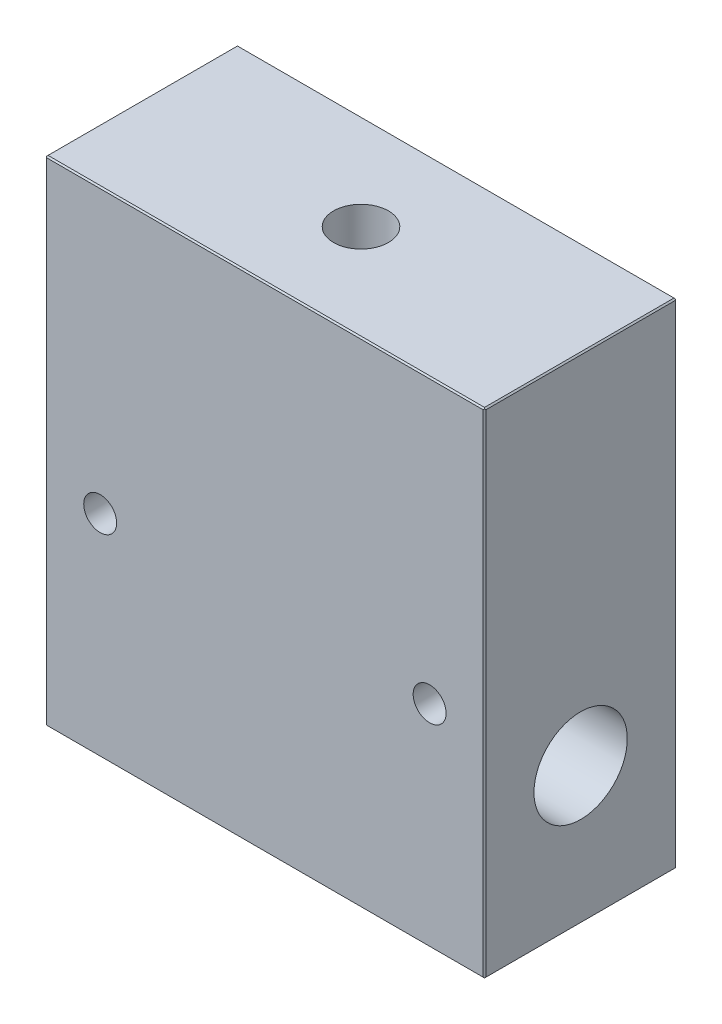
ISO-10303-21;
HEADER;
FILE_DESCRIPTION(('STEP AP214'),'2;1');
FILE_NAME('part.step','',(''),(''),'','','');
FILE_SCHEMA(('AUTOMOTIVE_DESIGN { 1 0 10303 214 1 1 1 1 }'));
ENDSEC;
DATA;
#1=APPLICATION_CONTEXT('core data for automotive mechanical design processes');
#2=APPLICATION_PROTOCOL_DEFINITION('international standard','automotive_design',2000,#1);
#3=PRODUCT_CONTEXT('',#1,'mechanical');
#4=PRODUCT('Part','Part','',(#3));
#5=PRODUCT_RELATED_PRODUCT_CATEGORY('part','',(#4));
#6=PRODUCT_DEFINITION_FORMATION('','',#4);
#7=PRODUCT_DEFINITION_CONTEXT('part definition',#1,'design');
#8=PRODUCT_DEFINITION('design','',#6,#7);
#9=PRODUCT_DEFINITION_SHAPE('','',#8);
#10=(LENGTH_UNIT() NAMED_UNIT(*) SI_UNIT(.MILLI.,.METRE.));
#11=(NAMED_UNIT(*) PLANE_ANGLE_UNIT() SI_UNIT($,.RADIAN.));
#12=(NAMED_UNIT(*) SI_UNIT($,.STERADIAN.) SOLID_ANGLE_UNIT());
#13=UNCERTAINTY_MEASURE_WITH_UNIT(LENGTH_MEASURE(1.E-05),#10,'distance_accuracy_value','');
#14=(GEOMETRIC_REPRESENTATION_CONTEXT(3) GLOBAL_UNCERTAINTY_ASSIGNED_CONTEXT((#13)) GLOBAL_UNIT_ASSIGNED_CONTEXT((#10,
#11,#12)) REPRESENTATION_CONTEXT('',''));
#15=CARTESIAN_POINT('',(0.,0.,0.));
#16=DIRECTION('',(0.,0.,1.));
#17=DIRECTION('',(1.,0.,0.));
#18=AXIS2_PLACEMENT_3D('',#15,#16,#17);
#19=CARTESIAN_POINT('',(92.4,-20.,0.));
#20=DIRECTION('',(-1.,0.,0.));
#21=DIRECTION('',(0.,0.,1.));
#22=AXIS2_PLACEMENT_3D('',#19,#20,#21);
#23=CYLINDRICAL_SURFACE('',#22,9.);
#24=CARTESIAN_POINT('',(80.,-20.,0.));
#25=DIRECTION('',(-1.,0.,0.));
#26=DIRECTION('',(0.,0.,1.));
#27=AXIS2_PLACEMENT_3D('',#24,#25,#26);
#28=CIRCLE('',#27,9.);
#29=CARTESIAN_POINT('',(80.,-20.,9.));
#30=VERTEX_POINT('',#29);
#31=EDGE_CURVE('P0_E10',#30,#30,#28,.T.);
#32=ORIENTED_EDGE('',*,*,#31,.T.);
#33=EDGE_LOOP('',(#32));
#34=FACE_BOUND('',#33,.T.);
#35=CARTESIAN_POINT('',(0.,-20.,0.));
#36=DIRECTION('',(-1.,0.,0.));
#37=DIRECTION('',(0.,0.,1.));
#38=AXIS2_PLACEMENT_3D('',#35,#36,#37);
#39=CIRCLE('',#38,9.);
#40=CARTESIAN_POINT('',(0.,-20.,9.));
#41=VERTEX_POINT('',#40);
#42=EDGE_CURVE('P0_E15',#41,#41,#39,.F.);
#43=ORIENTED_EDGE('',*,*,#42,.T.);
#44=EDGE_LOOP('',(#43));
#45=FACE_BOUND('',#44,.T.);
#46=ADVANCED_FACE('P0_F14',(#34,#45),#23,.T.);
#47=OPEN_SHELL('',(#46));
#48=SHELL_BASED_SURFACE_MODEL('P0_B1',(#47));
#49=CARTESIAN_POINT('',(57.86268102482,15.,0.));
#50=DIRECTION('',(-1.,0.,0.));
#51=DIRECTION('',(0.,0.,1.));
#52=AXIS2_PLACEMENT_3D('',#49,#50,#51);
#53=CYLINDRICAL_SURFACE('',#52,9.);
#54=CARTESIAN_POINT('',(20.,15.,0.));
#55=DIRECTION('',(-1.,0.,0.));
#56=DIRECTION('',(0.,0.,1.));
#57=AXIS2_PLACEMENT_3D('',#54,#55,#56);
#58=CIRCLE('',#57,9.);
#59=CARTESIAN_POINT('',(20.,15.,9.));
#60=VERTEX_POINT('',#59);
#61=EDGE_CURVE('P1_E11',#60,#60,#58,.T.);
#62=ORIENTED_EDGE('',*,*,#61,.T.);
#63=EDGE_LOOP('',(#62));
#64=FACE_BOUND('',#63,.T.);
#65=CARTESIAN_POINT('',(0.,15.,0.));
#66=DIRECTION('',(-1.,0.,0.));
#67=DIRECTION('',(0.,0.,1.));
#68=AXIS2_PLACEMENT_3D('',#65,#66,#67);
#69=CIRCLE('',#68,9.);
#70=CARTESIAN_POINT('',(0.,15.,9.));
#71=VERTEX_POINT('',#70);
#72=EDGE_CURVE('P1_E23',#71,#71,#69,.F.);
#73=ORIENTED_EDGE('',*,*,#72,.T.);
#74=EDGE_LOOP('',(#73));
#75=FACE_BOUND('',#74,.T.);
#76=ADVANCED_FACE('P1_F16',(#64,#75),#53,.T.);
#77=CARTESIAN_POINT('',(20.,15.,0.));
#78=DIRECTION('',(-1.,0.,0.));
#79=DIRECTION('',(0.,0.,1.));
#80=AXIS2_PLACEMENT_3D('',#77,#78,#79);
#81=PLANE('',#80);
#82=CARTESIAN_POINT('',(20.,23.5,0.));
#83=CARTESIAN_POINT('',(20.,23.499902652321,0.780112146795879));
#84=CARTESIAN_POINT('',(20.,23.3580956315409,1.54668594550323));
#85=CARTESIAN_POINT('',(20.,23.2077587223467,2.35937021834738));
#86=CARTESIAN_POINT('',(20.,22.9032005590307,3.12880503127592));
#87=CARTESIAN_POINT('',(20.,22.5862467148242,3.92955625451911));
#88=CARTESIAN_POINT('',(20.,22.1144618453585,4.65128290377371));
#89=CARTESIAN_POINT('',(20.,21.6331449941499,5.3875913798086));
#90=CARTESIAN_POINT('',(20.,21.0104076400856,6.01040764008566));
#91=CARTESIAN_POINT('',(20.,20.3884276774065,6.63246641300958));
#92=CARTESIAN_POINT('',(20.,19.6512829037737,7.11446184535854));
#93=CARTESIAN_POINT('',(20.,18.9304933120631,7.58576314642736));
#94=CARTESIAN_POINT('',(20.,18.1288050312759,7.90320055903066));
#95=CARTESIAN_POINT('',(20.,17.3603791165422,8.20746736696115));
#96=CARTESIAN_POINT('',(20.,16.5466859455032,8.35809563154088));
#97=CARTESIAN_POINT('',(20.,15.7803822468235,8.49995130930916));
#98=CARTESIAN_POINT('',(20.,15.,8.5));
#99=CARTESIAN_POINT('',(20.,14.2206769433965,8.50004862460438));
#100=CARTESIAN_POINT('',(20.,13.4533140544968,8.35809563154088));
#101=CARTESIAN_POINT('',(20.,12.6406297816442,8.20775872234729));
#102=CARTESIAN_POINT('',(20.,11.8711949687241,7.90320055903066));
#103=CARTESIAN_POINT('',(20.,11.0704437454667,7.58624671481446));
#104=CARTESIAN_POINT('',(20.,10.3487170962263,7.11446184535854));
#105=CARTESIAN_POINT('',(20.,9.61240862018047,6.63314499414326));
#106=CARTESIAN_POINT('',(20.,8.98959235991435,6.01040764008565));
#107=CARTESIAN_POINT('',(20.,8.36753358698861,5.3884276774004));
#108=CARTESIAN_POINT('',(20.,7.88553815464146,4.65128290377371));
#109=CARTESIAN_POINT('',(20.,7.41423685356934,3.93049331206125));
#110=CARTESIAN_POINT('',(20.,7.09679944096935,3.12880503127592));
#111=CARTESIAN_POINT('',(20.,6.79253263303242,2.36037911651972));
#112=CARTESIAN_POINT('',(20.,6.64190436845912,1.54668594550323));
#113=CARTESIAN_POINT('',(20.,6.50009741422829,0.780645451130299));
#114=CARTESIAN_POINT('',(20.,6.5,0.));
#115=B_SPLINE_CURVE_WITH_KNOTS('',2,(#82,#83,#84,#85,#86,#87,#88,#89,#90,#91,#92,#93,#94,#95,
#96,#97,#98,#99,#100,#101,#102,#103,#104,#105,#106,#107,#108,#109,#110,#111,#112,#113,#114),
.UNSPECIFIED.,.F.,.F.,(3,2,2,2,2,2,2,2,2,2,2,2,2,2,2,2,3),(0.,0.0625,0.125,0.1875,0.25,0.3125,
0.375,0.4375,0.5,0.5625,0.625,0.6875,0.75,0.8125,0.875,0.9375,1.),.UNSPECIFIED.);
#116=CARTESIAN_POINT('',(20.,23.5,0.));
#117=VERTEX_POINT('',#116);
#118=CARTESIAN_POINT('',(20.,6.5,0.));
#119=VERTEX_POINT('',#118);
#120=EDGE_CURVE('P1_E27',#117,#119,#115,.T.);
#121=ORIENTED_EDGE('',*,*,#120,.F.);
#122=CARTESIAN_POINT('',(20.,6.5,0.));
#123=CARTESIAN_POINT('',(20.,6.50009734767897,-0.780112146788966));
#124=CARTESIAN_POINT('',(20.,6.64190436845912,-1.54668594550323));
#125=CARTESIAN_POINT('',(20.,6.79224127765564,-2.35937021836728));
#126=CARTESIAN_POINT('',(20.,7.09679944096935,-3.12880503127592));
#127=CARTESIAN_POINT('',(20.,7.41375328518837,-3.92955625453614));
#128=CARTESIAN_POINT('',(20.,7.88553815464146,-4.65128290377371));
#129=CARTESIAN_POINT('',(20.,8.36685500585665,-5.38759137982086));
#130=CARTESIAN_POINT('',(20.,8.98959235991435,-6.01040764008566));
#131=CARTESIAN_POINT('',(20.,9.6115723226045,-6.63246641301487));
#132=CARTESIAN_POINT('',(20.,10.3487170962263,-7.11446184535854));
#133=CARTESIAN_POINT('',(20.,11.0695066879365,-7.5857631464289));
#134=CARTESIAN_POINT('',(20.,11.8711949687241,-7.90320055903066));
#135=CARTESIAN_POINT('',(20.,12.6396208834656,-8.2074673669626));
#136=CARTESIAN_POINT('',(20.,13.4533140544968,-8.35809563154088));
#137=CARTESIAN_POINT('',(20.,14.2196177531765,-8.49995130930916));
#138=CARTESIAN_POINT('',(20.,15.,-8.5));
#139=CARTESIAN_POINT('',(20.,15.7793230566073,-8.50004862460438));
#140=CARTESIAN_POINT('',(20.,16.5466859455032,-8.35809563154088));
#141=CARTESIAN_POINT('',(20.,17.3593702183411,-8.20775872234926));
#142=CARTESIAN_POINT('',(20.,18.1288050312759,-7.90320055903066));
#143=CARTESIAN_POINT('',(20.,18.9295562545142,-7.58624671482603));
#144=CARTESIAN_POINT('',(20.,19.6512829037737,-7.11446184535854));
#145=CARTESIAN_POINT('',(20.,20.3875913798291,-6.63314499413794));
#146=CARTESIAN_POINT('',(20.,21.0104076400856,-6.01040764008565));
#147=CARTESIAN_POINT('',(20.,21.6324664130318,-5.3884276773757));
#148=CARTESIAN_POINT('',(20.,22.1144618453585,-4.65128290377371));
#149=CARTESIAN_POINT('',(20.,22.5857631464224,-3.93049331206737));
#150=CARTESIAN_POINT('',(20.,22.9032005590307,-3.12880503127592));
#151=CARTESIAN_POINT('',(20.,23.2074673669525,-2.36037911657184));
#152=CARTESIAN_POINT('',(20.,23.3580956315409,-1.54668594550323));
#153=CARTESIAN_POINT('',(20.,23.4999025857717,-0.780645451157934));
#154=CARTESIAN_POINT('',(20.,23.5,0.));
#155=B_SPLINE_CURVE_WITH_KNOTS('',2,(#122,#123,#124,#125,#126,#127,#128,#129,#130,#131,#132,
#133,#134,#135,#136,#137,#138,#139,#140,#141,#142,#143,#144,#145,#146,#147,#148,#149,#150,#151,
#152,#153,#154),.UNSPECIFIED.,.F.,.F.,(3,2,2,2,2,2,2,2,2,2,2,2,2,2,2,2,3),(0.,0.0625,0.125,
0.1875,0.25,0.3125,0.375,0.4375,0.5,0.5625,0.625,0.6875,0.75,0.8125,0.875,0.9375,1.),.UNSPECIFIED.);
#156=EDGE_CURVE('P1_E32',#119,#117,#155,.T.);
#157=ORIENTED_EDGE('',*,*,#156,.F.);
#158=EDGE_LOOP('',(#121,#157));
#159=FACE_BOUND('',#158,.T.);
#160=ORIENTED_EDGE('',*,*,#61,.F.);
#161=EDGE_LOOP('',(#160));
#162=FACE_BOUND('',#161,.T.);
#163=ADVANCED_FACE('P1_F17',(#159,#162),#81,.F.);
#164=OPEN_SHELL('',(#76,#163));
#165=SHELL_BASED_SURFACE_MODEL('P1_B1',(#164));
#166=CARTESIAN_POINT('',(50.0000000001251,15.,0.));
#167=DIRECTION('',(-1.,0.,0.));
#168=DIRECTION('',(0.,0.,1.));
#169=AXIS2_PLACEMENT_3D('',#166,#167,#168);
#170=CONICAL_SURFACE('',#169,8.4999999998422,1.02974425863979);
#171=CARTESIAN_POINT('',(50.,15.,0.));
#172=DIRECTION('',(-1.,0.,0.));
#173=DIRECTION('',(0.,0.,1.));
#174=AXIS2_PLACEMENT_3D('',#171,#172,#173);
#175=CIRCLE('',#174,8.5);
#176=CARTESIAN_POINT('',(50.,15.,8.5));
#177=VERTEX_POINT('',#176);
#178=EDGE_CURVE('P2_E277',#177,#177,#175,.T.);
#179=ORIENTED_EDGE('',*,*,#178,.T.);
#180=EDGE_LOOP('',(#179));
#181=FACE_BOUND('',#180,.T.);
#182=CARTESIAN_POINT('',(55.107315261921,15.0000000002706,0.));
#183=VERTEX_POINT('',#182);
#184=VERTEX_LOOP('',#183);
#185=FACE_BOUND('',#184,.T.);
#186=ADVANCED_FACE('P2_F16',(#181,#185),#170,.F.);
#187=CARTESIAN_POINT('',(0.,-35.,0.));
#188=DIRECTION('',(0.,-1.,0.));
#189=DIRECTION('',(0.,0.,-1.));
#190=AXIS2_PLACEMENT_3D('',#187,#188,#189);
#191=PLANE('',#190);
#192=CARTESIAN_POINT('',(50.,-35.,0.));
#193=DIRECTION('',(0.,-1.,0.));
#194=DIRECTION('',(0.,0.,-1.));
#195=AXIS2_PLACEMENT_3D('',#192,#193,#194);
#196=CIRCLE('',#195,9.);
#197=CARTESIAN_POINT('',(50.,-35.,-9.));
#198=VERTEX_POINT('',#197);
#199=EDGE_CURVE('P2_E265',#198,#198,#196,.T.);
#200=ORIENTED_EDGE('',*,*,#199,.T.);
#201=EDGE_LOOP('',(#200));
#202=FACE_BOUND('',#201,.T.);
#203=ADVANCED_FACE('P2_F138',(#202),#191,.T.);
#204=CARTESIAN_POINT('',(40.,45.,0.));
#205=DIRECTION('',(0.,-1.,0.));
#206=DIRECTION('',(0.,0.,-1.));
#207=AXIS2_PLACEMENT_3D('',#204,#205,#206);
#208=CYLINDRICAL_SURFACE('',#207,5.);
#209=CARTESIAN_POINT('',(45.,23.5,0.));
#210=CARTESIAN_POINT('',(44.9999988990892,23.4999989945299,0.128357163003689));
#211=CARTESIAN_POINT('',(44.9950492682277,23.4970848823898,0.256756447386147));
#212=CARTESIAN_POINT('',(44.975311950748,23.485497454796,0.512592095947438));
#213=CARTESIAN_POINT('',(44.9605179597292,23.4768204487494,0.640027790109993));
#214=CARTESIAN_POINT('',(44.9212497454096,23.4539011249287,0.893160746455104));
#215=CARTESIAN_POINT('',(44.8967558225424,23.439647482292,1.01885392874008));
#216=CARTESIAN_POINT('',(44.8383943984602,23.4059201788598,1.26737663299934));
#217=CARTESIAN_POINT('',(44.8045228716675,23.3864442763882,1.39020490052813));
#218=CARTESIAN_POINT('',(44.7280157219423,23.3428501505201,1.63150131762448));
#219=CARTESIAN_POINT('',(44.6854283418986,23.3187575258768,1.74998940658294));
#220=CARTESIAN_POINT('',(44.5918227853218,23.2663981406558,1.98265195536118));
#221=CARTESIAN_POINT('',(44.5408013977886,23.2381297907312,2.09682475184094));
#222=CARTESIAN_POINT('',(44.3758588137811,23.1479819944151,2.43181103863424));
#223=CARTESIAN_POINT('',(44.24995724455,23.0807000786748,2.64540972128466));
#224=CARTESIAN_POINT('',(43.9594785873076,22.9316312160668,3.06471449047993));
#225=CARTESIAN_POINT('',(43.7927133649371,22.8491358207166,3.26863586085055));
#226=CARTESIAN_POINT('',(43.4300750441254,22.6804704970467,3.64738378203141));
#227=CARTESIAN_POINT('',(43.2341655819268,22.5942960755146,3.82217339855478));
#228=CARTESIAN_POINT('',(42.7918352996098,22.4161059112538,4.15831930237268));
#229=CARTESIAN_POINT('',(42.542187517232,22.3245831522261,4.31572343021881));
#230=CARTESIAN_POINT('',(42.0146123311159,22.1586631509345,4.58571331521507));
#231=CARTESIAN_POINT('',(41.7367306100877,22.084238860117,4.69837006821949));
#232=CARTESIAN_POINT('',(41.2267586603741,21.9791149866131,4.85268557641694));
#233=CARTESIAN_POINT('',(40.9990955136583,21.9422668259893,4.90477317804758));
#234=CARTESIAN_POINT('',(40.5363562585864,21.8909400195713,4.97664312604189));
#235=CARTESIAN_POINT('',(40.3012891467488,21.8764352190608,4.9964632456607));
#236=CARTESIAN_POINT('',(39.8300745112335,21.8719194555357,5.00267390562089));
#237=CARTESIAN_POINT('',(39.5939258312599,21.8819500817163,4.98900768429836));
#238=CARTESIAN_POINT('',(39.1279302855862,21.925064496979,4.92897337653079));
#239=CARTESIAN_POINT('',(38.8980881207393,21.958165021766,4.88258154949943));
#240=CARTESIAN_POINT('',(38.4524390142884,22.0425387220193,4.76004758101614));
#241=CARTESIAN_POINT('',(38.2365252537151,22.093647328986,4.68417423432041));
#242=CARTESIAN_POINT('',(37.8198741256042,22.2085198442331,4.50538583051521));
#243=CARTESIAN_POINT('',(37.6191424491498,22.2722884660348,4.40246069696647));
#244=CARTESIAN_POINT('',(37.2025657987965,22.418312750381,4.15246403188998));
#245=CARTESIAN_POINT('',(36.9898944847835,22.5018717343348,4.0008723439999));
#246=CARTESIAN_POINT('',(36.59078424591,22.6707247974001,3.66674230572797));
#247=CARTESIAN_POINT('',(36.4043699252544,22.7560204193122,3.48417527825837));
#248=CARTESIAN_POINT('',(36.1359620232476,22.8850247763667,3.17662235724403));
#249=CARTESIAN_POINT('',(36.0438273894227,22.9306793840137,3.0611484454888));
#250=CARTESIAN_POINT('',(35.8696714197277,23.0189758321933,2.82175037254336));
#251=CARTESIAN_POINT('',(35.7876463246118,23.0616187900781,2.69782937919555));
#252=CARTESIAN_POINT('',(35.6344553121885,23.142712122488,2.44217642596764));
#253=CARTESIAN_POINT('',(35.5632874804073,23.1811632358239,2.31044584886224));
#254=CARTESIAN_POINT('',(35.4326065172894,23.2527627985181,2.03996506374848));
#255=CARTESIAN_POINT('',(35.3730899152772,23.2859128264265,1.90121696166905));
#256=CARTESIAN_POINT('',(35.2766002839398,23.3402178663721,1.64455871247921));
#257=CARTESIAN_POINT('',(35.2374925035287,23.3624556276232,1.5276755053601));
#258=CARTESIAN_POINT('',(35.1678618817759,23.4023057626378,1.29061751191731));
#259=CARTESIAN_POINT('',(35.1373374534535,23.4199189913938,1.17044333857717));
#260=CARTESIAN_POINT('',(35.0852840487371,23.4500878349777,0.927858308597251));
#261=CARTESIAN_POINT('',(35.0637328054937,23.4626559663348,0.805453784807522));
#262=CARTESIAN_POINT('',(35.0297918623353,23.4824983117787,0.559004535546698));
#263=CARTESIAN_POINT('',(35.0173968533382,23.4897755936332,0.434960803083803));
#264=CARTESIAN_POINT('',(35.0064382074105,23.4962141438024,0.258891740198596));
#265=CARTESIAN_POINT('',(35.0040248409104,23.4976329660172,0.207158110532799));
#266=CARTESIAN_POINT('',(35.0008054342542,23.4995261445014,0.103618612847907));
#267=CARTESIAN_POINT('',(34.9999995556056,23.5000004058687,0.051812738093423));
#268=CARTESIAN_POINT('',(35.0000011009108,23.4999989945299,-0.128357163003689));
#269=CARTESIAN_POINT('',(35.0049507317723,23.4970848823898,-0.256756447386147));
#270=CARTESIAN_POINT('',(35.024688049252,23.485497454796,-0.512592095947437));
#271=CARTESIAN_POINT('',(35.0394820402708,23.4768204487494,-0.640027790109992));
#272=CARTESIAN_POINT('',(35.0787502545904,23.4539011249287,-0.893160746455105));
#273=CARTESIAN_POINT('',(35.1032441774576,23.439647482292,-1.01885392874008));
#274=CARTESIAN_POINT('',(35.1616056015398,23.4059201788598,-1.26737663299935));
#275=CARTESIAN_POINT('',(35.1954771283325,23.3864442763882,-1.39020490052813));
#276=CARTESIAN_POINT('',(35.2719842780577,23.3428501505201,-1.63150131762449));
#277=CARTESIAN_POINT('',(35.3145716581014,23.3187575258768,-1.74998940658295));
#278=CARTESIAN_POINT('',(35.4081772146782,23.2663981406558,-1.98265195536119));
#279=CARTESIAN_POINT('',(35.4591986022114,23.2381297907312,-2.09682475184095));
#280=CARTESIAN_POINT('',(35.6241411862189,23.1479819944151,-2.43181103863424));
#281=CARTESIAN_POINT('',(35.75004275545,23.0807000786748,-2.64540972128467));
#282=CARTESIAN_POINT('',(36.0405214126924,22.9316312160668,-3.06471449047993));
#283=CARTESIAN_POINT('',(36.2072866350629,22.8491358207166,-3.26863586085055));
#284=CARTESIAN_POINT('',(36.5699249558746,22.6804704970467,-3.64738378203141));
#285=CARTESIAN_POINT('',(36.7658344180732,22.5942960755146,-3.82217339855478));
#286=CARTESIAN_POINT('',(37.2081647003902,22.4161059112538,-4.15831930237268));
#287=CARTESIAN_POINT('',(37.457812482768,22.3245831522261,-4.31572343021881));
#288=CARTESIAN_POINT('',(37.9853876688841,22.1586631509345,-4.58571331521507));
#289=CARTESIAN_POINT('',(38.2632693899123,22.084238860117,-4.69837006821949));
#290=CARTESIAN_POINT('',(38.773241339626,21.9791149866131,-4.85268557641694));
#291=CARTESIAN_POINT('',(39.0009044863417,21.9422668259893,-4.90477317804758));
#292=CARTESIAN_POINT('',(39.4636437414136,21.8909400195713,-4.97664312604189));
#293=CARTESIAN_POINT('',(39.6987108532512,21.8764352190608,-4.9964632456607));
#294=CARTESIAN_POINT('',(40.1699254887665,21.8719194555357,-5.00267390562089));
#295=CARTESIAN_POINT('',(40.4060741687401,21.8819500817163,-4.98900768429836));
#296=CARTESIAN_POINT('',(40.8720697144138,21.925064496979,-4.92897337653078));
#297=CARTESIAN_POINT('',(41.1019118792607,21.958165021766,-4.88258154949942));
#298=CARTESIAN_POINT('',(41.5475609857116,22.0425387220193,-4.76004758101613));
#299=CARTESIAN_POINT('',(41.763474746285,22.093647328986,-4.6841742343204));
#300=CARTESIAN_POINT('',(42.1801258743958,22.2085198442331,-4.50538583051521));
#301=CARTESIAN_POINT('',(42.3808575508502,22.2722884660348,-4.40246069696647));
#302=CARTESIAN_POINT('',(42.7974342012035,22.418312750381,-4.15246403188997));
#303=CARTESIAN_POINT('',(43.0101055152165,22.5018717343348,-4.00087234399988));
#304=CARTESIAN_POINT('',(43.40921575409,22.6707247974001,-3.66674230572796));
#305=CARTESIAN_POINT('',(43.5956300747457,22.7560204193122,-3.48417527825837));
#306=CARTESIAN_POINT('',(43.8640379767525,22.8850247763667,-3.17662235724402));
#307=CARTESIAN_POINT('',(43.9561726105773,22.9306793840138,-3.06114844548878));
#308=CARTESIAN_POINT('',(44.1303285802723,23.0189758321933,-2.82175037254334));
#309=CARTESIAN_POINT('',(44.2123536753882,23.0616187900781,-2.69782937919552));
#310=CARTESIAN_POINT('',(44.3655446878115,23.142712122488,-2.44217642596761));
#311=CARTESIAN_POINT('',(44.4367125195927,23.1811632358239,-2.31044584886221));
#312=CARTESIAN_POINT('',(44.5673934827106,23.2527627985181,-2.03996506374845));
#313=CARTESIAN_POINT('',(44.6269100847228,23.2859128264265,-1.90121696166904));
#314=CARTESIAN_POINT('',(44.7233997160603,23.3402178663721,-1.64455871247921));
#315=CARTESIAN_POINT('',(44.7625074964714,23.3624556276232,-1.52767550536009));
#316=CARTESIAN_POINT('',(44.8321381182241,23.4023057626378,-1.29061751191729));
#317=CARTESIAN_POINT('',(44.8626625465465,23.4199189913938,-1.17044333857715));
#318=CARTESIAN_POINT('',(44.9147159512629,23.4500878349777,-0.927858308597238));
#319=CARTESIAN_POINT('',(44.9362671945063,23.4626559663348,-0.80545378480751));
#320=CARTESIAN_POINT('',(44.9702081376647,23.4824983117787,-0.559004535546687));
#321=CARTESIAN_POINT('',(44.9826031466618,23.4897755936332,-0.434960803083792));
#322=CARTESIAN_POINT('',(44.9935617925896,23.4962141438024,-0.258891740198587));
#323=CARTESIAN_POINT('',(44.9959751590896,23.4976329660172,-0.207158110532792));
#324=CARTESIAN_POINT('',(44.9991945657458,23.4995261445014,-0.103618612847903));
#325=CARTESIAN_POINT('',(45.0000004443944,23.5000004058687,-0.0518127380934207));
#326=CARTESIAN_POINT('',(45.,23.5,0.));
#327=B_SPLINE_CURVE_WITH_KNOTS('',3,(#209,#210,#211,#212,#213,#214,#215,#216,#217,#218,#219,
#220,#221,#222,#223,#224,#225,#226,#227,#228,#229,#230,#231,#232,#233,#234,#235,#236,#237,#238,
#239,#240,#241,#242,#243,#244,#245,#246,#247,#248,#249,#250,#251,#252,#253,#254,#255,#256,#257,
#258,#259,#260,#261,#262,#263,#264,#265,#266,#267,#268,#269,#270,#271,#272,#273,#274,#275,#276,
#277,#278,#279,#280,#281,#282,#283,#284,#285,#286,#287,#288,#289,#290,#291,#292,#293,#294,#295,
#296,#297,#298,#299,#300,#301,#302,#303,#304,#305,#306,#307,#308,#309,#310,#311,#312,#313,#314,
#315,#316,#317,#318,#319,#320,#321,#322,#323,#324,#325,#326),.UNSPECIFIED.,.T.,.F.,(4,2,2,2,2,2,
2,2,2,2,2,2,2,2,2,2,2,2,2,2,2,2,2,2,2,2,2,2,2,2,2,2,2,2,2,2,2,2,2,2,2,2,2,2,2,2,2,2,2,2,2,2,2,2,
2,2,2,2,4),(0.,0.38501700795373,0.770280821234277,1.15633111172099,1.54254738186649,
1.92668108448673,2.31096137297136,3.07851763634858,3.90347279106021,4.72946602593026,
5.65191433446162,6.57289319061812,7.27916762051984,7.98461466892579,8.69125832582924,
9.39841514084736,10.0992703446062,10.8003869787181,11.6199219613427,12.4402198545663,
12.9035785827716,13.3667644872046,13.8298686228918,14.2928345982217,14.6681669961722,
15.0434299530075,15.417756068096,15.7918649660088,15.9472655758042,16.1026817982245,
16.4876988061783,16.8729626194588,17.2590129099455,17.645229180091,18.0293628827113,
18.4136431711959,19.1811994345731,20.0061545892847,20.8321478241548,21.7545961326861,
22.6755749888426,23.3818494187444,24.0872964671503,24.7939401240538,25.5010969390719,
26.2019521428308,26.9030687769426,27.7226037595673,28.5429016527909,29.0062603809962,
29.4694462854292,29.9325504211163,30.3955163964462,30.7708487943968,31.146111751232,
31.5204378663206,31.8945467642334,32.0499473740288,32.2053635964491),.UNSPECIFIED.);
#328=CARTESIAN_POINT('',(45.,23.5,0.));
#329=VERTEX_POINT('',#328);
#330=EDGE_CURVE('P2_E19',#329,#329,#327,.T.);
#331=ORIENTED_EDGE('',*,*,#330,.T.);
#332=EDGE_LOOP('',(#331));
#333=FACE_BOUND('',#332,.T.);
#334=CARTESIAN_POINT('',(40.,45.,0.));
#335=DIRECTION('',(0.,-1.,0.));
#336=DIRECTION('',(0.,0.,-1.));
#337=AXIS2_PLACEMENT_3D('',#334,#335,#336);
#338=CIRCLE('',#337,5.);
#339=CARTESIAN_POINT('',(40.,45.,-5.));
#340=VERTEX_POINT('',#339);
#341=EDGE_CURVE('P2_E253',#340,#340,#338,.T.);
#342=ORIENTED_EDGE('',*,*,#341,.F.);
#343=EDGE_LOOP('',(#342));
#344=FACE_BOUND('',#343,.T.);
#345=ADVANCED_FACE('P2_F145',(#333,#344),#208,.F.);
#346=CARTESIAN_POINT('',(0.125,44.875,0.));
#347=DIRECTION('',(-0.707106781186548,0.707106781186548,0.));
#348=DIRECTION('',(-0.707106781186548,-0.707106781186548,0.));
#349=AXIS2_PLACEMENT_3D('',#346,#347,#348);
#350=PLANE('',#349);
#351=DIRECTION('',(0.577350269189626,0.577350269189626,-0.577350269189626));
#352=VECTOR('',#351,1.);
#353=CARTESIAN_POINT('',(0.125,44.875,17.375));
#354=LINE('',#353,#352);
#355=CARTESIAN_POINT('',(0.124999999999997,44.875,17.375));
#356=VERTEX_POINT('',#355);
#357=CARTESIAN_POINT('',(0.249999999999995,45.,17.25));
#358=VERTEX_POINT('',#357);
#359=EDGE_CURVE('P2_E133',#356,#358,#354,.T.);
#360=ORIENTED_EDGE('',*,*,#359,.T.);
#361=DIRECTION('',(0.,0.,1.));
#362=VECTOR('',#361,1.);
#363=CARTESIAN_POINT('',(0.25,45.,-17.5));
#364=LINE('',#363,#362);
#365=CARTESIAN_POINT('',(0.249999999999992,45.,-17.25));
#366=VERTEX_POINT('',#365);
#367=EDGE_CURVE('P2_E327',#366,#358,#364,.T.);
#368=ORIENTED_EDGE('',*,*,#367,.F.);
#369=DIRECTION('',(0.577350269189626,0.577350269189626,0.577350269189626));
#370=VECTOR('',#369,1.);
#371=CARTESIAN_POINT('',(0.124999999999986,44.875,-17.375));
#372=LINE('',#371,#370);
#373=CARTESIAN_POINT('',(0.124999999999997,44.875,-17.375));
#374=VERTEX_POINT('',#373);
#375=EDGE_CURVE('P2_E341',#374,#366,#372,.T.);
#376=ORIENTED_EDGE('',*,*,#375,.F.);
#377=DIRECTION('',(0.577350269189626,0.577350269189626,-0.577350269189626));
#378=VECTOR('',#377,1.);
#379=CARTESIAN_POINT('',(0.,44.75,-17.25));
#380=LINE('',#379,#378);
#381=CARTESIAN_POINT('',(0.,44.75,-17.25));
#382=VERTEX_POINT('',#381);
#383=EDGE_CURVE('P2_E355',#382,#374,#380,.T.);
#384=ORIENTED_EDGE('',*,*,#383,.F.);
#385=DIRECTION('',(0.,0.,-1.));
#386=VECTOR('',#385,1.);
#387=CARTESIAN_POINT('',(0.,44.75,0.));
#388=LINE('',#387,#386);
#389=CARTESIAN_POINT('',(0.,44.75,17.25));
#390=VERTEX_POINT('',#389);
#391=EDGE_CURVE('P2_E315',#382,#390,#388,.F.);
#392=ORIENTED_EDGE('',*,*,#391,.T.);
#393=DIRECTION('',(0.577350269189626,0.577350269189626,0.577350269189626));
#394=VECTOR('',#393,1.);
#395=CARTESIAN_POINT('',(0.,44.75,17.25));
#396=LINE('',#395,#394);
#397=EDGE_CURVE('P2_E282',#390,#356,#396,.T.);
#398=ORIENTED_EDGE('',*,*,#397,.T.);
#399=EDGE_LOOP('',(#360,#368,#376,#384,#392,#398));
#400=FACE_BOUND('',#399,.T.);
#401=ADVANCED_FACE('P2_F238',(#400),#350,.T.);
#402=CARTESIAN_POINT('',(57.86268102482,15.,0.));
#403=DIRECTION('',(-1.,0.,0.));
#404=DIRECTION('',(0.,0.,1.));
#405=AXIS2_PLACEMENT_3D('',#402,#403,#404);
#406=CYLINDRICAL_SURFACE('',#405,8.5);
#407=CARTESIAN_POINT('',(0.,15.,0.));
#408=DIRECTION('',(-1.,0.,0.));
#409=DIRECTION('',(0.,0.,1.));
#410=AXIS2_PLACEMENT_3D('',#407,#408,#409);
#411=CIRCLE('',#410,8.5);
#412=CARTESIAN_POINT('',(0.,15.,8.5));
#413=VERTEX_POINT('',#412);
#414=EDGE_CURVE('P2_E263',#413,#413,#411,.T.);
#415=ORIENTED_EDGE('',*,*,#414,.T.);
#416=EDGE_LOOP('',(#415));
#417=FACE_BOUND('',#416,.T.);
#418=ORIENTED_EDGE('',*,*,#178,.F.);
#419=EDGE_LOOP('',(#418));
#420=FACE_BOUND('',#419,.T.);
#421=ORIENTED_EDGE('',*,*,#330,.F.);
#422=EDGE_LOOP('',(#421));
#423=FACE_BOUND('',#422,.T.);
#424=ADVANCED_FACE('P2_F233',(#417,#420,#423),#406,.F.);
#425=CARTESIAN_POINT('',(0.125,-44.875,0.));
#426=DIRECTION('',(-0.707106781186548,-0.707106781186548,0.));
#427=DIRECTION('',(0.707106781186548,-0.707106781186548,0.));
#428=AXIS2_PLACEMENT_3D('',#425,#426,#427);
#429=PLANE('',#428);
#430=DIRECTION('',(-0.577350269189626,0.577350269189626,-0.577350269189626));
#431=VECTOR('',#430,1.);
#432=CARTESIAN_POINT('',(0.125,-44.875,17.375));
#433=LINE('',#432,#431);
#434=CARTESIAN_POINT('',(0.124999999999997,-44.875,17.375));
#435=VERTEX_POINT('',#434);
#436=CARTESIAN_POINT('',(0.,-44.75,17.25));
#437=VERTEX_POINT('',#436);
#438=EDGE_CURVE('P2_E268',#435,#437,#433,.T.);
#439=ORIENTED_EDGE('',*,*,#438,.T.);
#440=DIRECTION('',(0.,0.,-1.));
#441=VECTOR('',#440,1.);
#442=CARTESIAN_POINT('',(0.,-44.75,0.));
#443=LINE('',#442,#441);
#444=CARTESIAN_POINT('',(0.,-44.75,-17.25));
#445=VERTEX_POINT('',#444);
#446=EDGE_CURVE('P2_E254',#437,#445,#443,.T.);
#447=ORIENTED_EDGE('',*,*,#446,.T.);
#448=DIRECTION('',(-0.577350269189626,0.577350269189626,0.577350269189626));
#449=VECTOR('',#448,1.);
#450=CARTESIAN_POINT('',(0.125,-44.875,-17.375));
#451=LINE('',#450,#449);
#452=CARTESIAN_POINT('',(0.124999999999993,-44.875,-17.375));
#453=VERTEX_POINT('',#452);
#454=EDGE_CURVE('P2_E349',#453,#445,#451,.T.);
#455=ORIENTED_EDGE('',*,*,#454,.F.);
#456=DIRECTION('',(-0.577350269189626,0.577350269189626,-0.577350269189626));
#457=VECTOR('',#456,1.);
#458=CARTESIAN_POINT('',(0.249999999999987,-45.,-17.25));
#459=LINE('',#458,#457);
#460=CARTESIAN_POINT('',(0.249999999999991,-45.,-17.25));
#461=VERTEX_POINT('',#460);
#462=EDGE_CURVE('P2_E357',#461,#453,#459,.T.);
#463=ORIENTED_EDGE('',*,*,#462,.F.);
#464=DIRECTION('',(0.,0.,-1.));
#465=VECTOR('',#464,1.);
#466=CARTESIAN_POINT('',(0.25,-45.,17.5));
#467=LINE('',#466,#465);
#468=CARTESIAN_POINT('',(0.249999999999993,-45.,17.25));
#469=VERTEX_POINT('',#468);
#470=EDGE_CURVE('P2_E305',#469,#461,#467,.T.);
#471=ORIENTED_EDGE('',*,*,#470,.F.);
#472=DIRECTION('',(-0.577350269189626,0.577350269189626,0.577350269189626));
#473=VECTOR('',#472,1.);
#474=CARTESIAN_POINT('',(0.25,-45.,17.25));
#475=LINE('',#474,#473);
#476=EDGE_CURVE('P2_E273',#469,#435,#475,.T.);
#477=ORIENTED_EDGE('',*,*,#476,.T.);
#478=EDGE_LOOP('',(#439,#447,#455,#463,#471,#477));
#479=FACE_BOUND('',#478,.T.);
#480=ADVANCED_FACE('P2_F230',(#479),#429,.T.);
#481=CARTESIAN_POINT('',(50.,-45.,0.));
#482=DIRECTION('',(0.,-1.,0.));
#483=DIRECTION('',(0.,0.,-1.));
#484=AXIS2_PLACEMENT_3D('',#481,#482,#483);
#485=CYLINDRICAL_SURFACE('',#484,9.);
#486=ORIENTED_EDGE('',*,*,#199,.F.);
#487=EDGE_LOOP('',(#486));
#488=FACE_BOUND('',#487,.T.);
#489=CARTESIAN_POINT('',(50.,-45.,0.));
#490=DIRECTION('',(0.,-1.,0.));
#491=DIRECTION('',(0.,0.,-1.));
#492=AXIS2_PLACEMENT_3D('',#489,#490,#491);
#493=CIRCLE('',#492,9.);
#494=CARTESIAN_POINT('',(50.,-45.,-9.));
#495=VERTEX_POINT('',#494);
#496=EDGE_CURVE('P2_E302',#495,#495,#493,.F.);
#497=ORIENTED_EDGE('',*,*,#496,.F.);
#498=EDGE_LOOP('',(#497));
#499=FACE_BOUND('',#498,.T.);
#500=ADVANCED_FACE('P2_F226',(#488,#499),#485,.F.);
#501=CARTESIAN_POINT('',(79.875,-44.875,0.));
#502=DIRECTION('',(0.707106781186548,-0.707106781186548,0.));
#503=DIRECTION('',(0.707106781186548,0.707106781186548,0.));
#504=AXIS2_PLACEMENT_3D('',#501,#502,#503);
#505=PLANE('',#504);
#506=DIRECTION('',(-0.577350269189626,-0.577350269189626,-0.577350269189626));
#507=VECTOR('',#506,1.);
#508=CARTESIAN_POINT('',(79.875,-44.875,17.375));
#509=LINE('',#508,#507);
#510=CARTESIAN_POINT('',(79.875,-44.875,17.375));
#511=VERTEX_POINT('',#510);
#512=CARTESIAN_POINT('',(79.75,-45.,17.25));
#513=VERTEX_POINT('',#512);
#514=EDGE_CURVE('P2_E271',#511,#513,#509,.T.);
#515=ORIENTED_EDGE('',*,*,#514,.T.);
#516=DIRECTION('',(0.,0.,-1.));
#517=VECTOR('',#516,1.);
#518=CARTESIAN_POINT('',(79.75,-45.,17.5));
#519=LINE('',#518,#517);
#520=CARTESIAN_POINT('',(79.75,-45.,-17.25));
#521=VERTEX_POINT('',#520);
#522=EDGE_CURVE('P2_E312',#521,#513,#519,.F.);
#523=ORIENTED_EDGE('',*,*,#522,.F.);
#524=DIRECTION('',(-0.577350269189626,-0.577350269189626,0.577350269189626));
#525=VECTOR('',#524,1.);
#526=CARTESIAN_POINT('',(79.875,-44.875,-17.375));
#527=LINE('',#526,#525);
#528=CARTESIAN_POINT('',(79.875,-44.875,-17.375));
#529=VERTEX_POINT('',#528);
#530=EDGE_CURVE('P2_E359',#529,#521,#527,.T.);
#531=ORIENTED_EDGE('',*,*,#530,.F.);
#532=DIRECTION('',(-0.577350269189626,-0.577350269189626,-0.577350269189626));
#533=VECTOR('',#532,1.);
#534=CARTESIAN_POINT('',(80.,-44.75,-17.25));
#535=LINE('',#534,#533);
#536=CARTESIAN_POINT('',(80.,-44.75,-17.25));
#537=VERTEX_POINT('',#536);
#538=EDGE_CURVE('P2_E333',#537,#529,#535,.T.);
#539=ORIENTED_EDGE('',*,*,#538,.F.);
#540=DIRECTION('',(0.,0.,-1.));
#541=VECTOR('',#540,1.);
#542=CARTESIAN_POINT('',(80.,-44.75,0.));
#543=LINE('',#542,#541);
#544=CARTESIAN_POINT('',(80.,-44.75,17.25));
#545=VERTEX_POINT('',#544);
#546=EDGE_CURVE('P2_E304',#545,#537,#543,.T.);
#547=ORIENTED_EDGE('',*,*,#546,.F.);
#548=DIRECTION('',(-0.577350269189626,-0.577350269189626,0.577350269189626));
#549=VECTOR('',#548,1.);
#550=CARTESIAN_POINT('',(80.,-44.75,17.25));
#551=LINE('',#550,#549);
#552=EDGE_CURVE('P2_E267',#545,#511,#551,.T.);
#553=ORIENTED_EDGE('',*,*,#552,.T.);
#554=EDGE_LOOP('',(#515,#523,#531,#539,#547,#553));
#555=FACE_BOUND('',#554,.T.);
#556=ADVANCED_FACE('P2_F222',(#555),#505,.T.);
#557=CARTESIAN_POINT('',(79.875,44.875,0.));
#558=DIRECTION('',(0.707106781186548,0.707106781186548,0.));
#559=DIRECTION('',(-0.707106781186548,0.707106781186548,0.));
#560=AXIS2_PLACEMENT_3D('',#557,#558,#559);
#561=PLANE('',#560);
#562=DIRECTION('',(0.577350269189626,-0.577350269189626,-0.577350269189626));
#563=VECTOR('',#562,1.);
#564=CARTESIAN_POINT('',(79.875,44.875,17.375));
#565=LINE('',#564,#563);
#566=CARTESIAN_POINT('',(79.875,44.875,17.375));
#567=VERTEX_POINT('',#566);
#568=CARTESIAN_POINT('',(80.,44.75,17.25));
#569=VERTEX_POINT('',#568);
#570=EDGE_CURVE('P2_E361',#567,#569,#565,.T.);
#571=ORIENTED_EDGE('',*,*,#570,.T.);
#572=DIRECTION('',(0.,0.,-1.));
#573=VECTOR('',#572,1.);
#574=CARTESIAN_POINT('',(80.,44.75,0.));
#575=LINE('',#574,#573);
#576=CARTESIAN_POINT('',(80.,44.75,-17.25));
#577=VERTEX_POINT('',#576);
#578=EDGE_CURVE('P2_E301',#577,#569,#575,.F.);
#579=ORIENTED_EDGE('',*,*,#578,.F.);
#580=DIRECTION('',(0.577350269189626,-0.577350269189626,0.577350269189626));
#581=VECTOR('',#580,1.);
#582=CARTESIAN_POINT('',(79.875,44.875,-17.375));
#583=LINE('',#582,#581);
#584=CARTESIAN_POINT('',(79.875,44.875,-17.375));
#585=VERTEX_POINT('',#584);
#586=EDGE_CURVE('P2_E336',#585,#577,#583,.T.);
#587=ORIENTED_EDGE('',*,*,#586,.F.);
#588=DIRECTION('',(0.577350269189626,-0.577350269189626,-0.577350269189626));
#589=VECTOR('',#588,1.);
#590=CARTESIAN_POINT('',(79.75,45.,-17.25));
#591=LINE('',#590,#589);
#592=CARTESIAN_POINT('',(79.75,45.,-17.25));
#593=VERTEX_POINT('',#592);
#594=EDGE_CURVE('P2_E347',#593,#585,#591,.T.);
#595=ORIENTED_EDGE('',*,*,#594,.F.);
#596=DIRECTION('',(0.,0.,1.));
#597=VECTOR('',#596,1.);
#598=CARTESIAN_POINT('',(79.75,45.,-17.5));
#599=LINE('',#598,#597);
#600=CARTESIAN_POINT('',(79.75,45.,17.25));
#601=VERTEX_POINT('',#600);
#602=EDGE_CURVE('P2_E260',#601,#593,#599,.F.);
#603=ORIENTED_EDGE('',*,*,#602,.F.);
#604=DIRECTION('',(0.577350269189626,-0.577350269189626,0.577350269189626));
#605=VECTOR('',#604,1.);
#606=CARTESIAN_POINT('',(79.75,45.,17.25));
#607=LINE('',#606,#605);
#608=EDGE_CURVE('P2_E363',#601,#567,#607,.T.);
#609=ORIENTED_EDGE('',*,*,#608,.T.);
#610=EDGE_LOOP('',(#571,#579,#587,#595,#603,#609));
#611=FACE_BOUND('',#610,.T.);
#612=ADVANCED_FACE('P2_F218',(#611),#561,.T.);
#613=CARTESIAN_POINT('',(92.4,-20.,0.));
#614=DIRECTION('',(-1.,0.,0.));
#615=DIRECTION('',(0.,0.,1.));
#616=AXIS2_PLACEMENT_3D('',#613,#614,#615);
#617=CYLINDRICAL_SURFACE('',#616,8.5);
#618=CARTESIAN_POINT('',(80.,-20.,0.));
#619=DIRECTION('',(-1.,0.,0.));
#620=DIRECTION('',(0.,0.,1.));
#621=AXIS2_PLACEMENT_3D('',#618,#619,#620);
#622=CIRCLE('',#621,8.5);
#623=CARTESIAN_POINT('',(80.,-20.,8.5));
#624=VERTEX_POINT('',#623);
#625=EDGE_CURVE('P2_E297',#624,#624,#622,.T.);
#626=ORIENTED_EDGE('',*,*,#625,.F.);
#627=EDGE_LOOP('',(#626));
#628=FACE_BOUND('',#627,.T.);
#629=CARTESIAN_POINT('',(0.,-20.,0.));
#630=DIRECTION('',(-1.,0.,0.));
#631=DIRECTION('',(0.,0.,1.));
#632=AXIS2_PLACEMENT_3D('',#629,#630,#631);
#633=CIRCLE('',#632,8.5);
#634=CARTESIAN_POINT('',(0.,-20.,8.5));
#635=VERTEX_POINT('',#634);
#636=EDGE_CURVE('P2_E306',#635,#635,#633,.T.);
#637=ORIENTED_EDGE('',*,*,#636,.T.);
#638=EDGE_LOOP('',(#637));
#639=FACE_BOUND('',#638,.T.);
#640=ADVANCED_FACE('P2_F214',(#628,#639),#617,.F.);
#641=CARTESIAN_POINT('',(40.,-44.875,-17.375));
#642=DIRECTION('',(0.,-0.707106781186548,-0.707106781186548));
#643=DIRECTION('',(0.,0.707106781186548,-0.707106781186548));
#644=AXIS2_PLACEMENT_3D('',#641,#642,#643);
#645=PLANE('',#644);
#646=DIRECTION('',(-0.577350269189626,-0.577350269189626,0.577350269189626));
#647=VECTOR('',#646,1.);
#648=CARTESIAN_POINT('',(0.25,-44.75,-17.5));
#649=LINE('',#648,#647);
#650=CARTESIAN_POINT('',(0.249999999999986,-44.75,-17.5));
#651=VERTEX_POINT('',#650);
#652=EDGE_CURVE('P2_E352',#651,#453,#649,.T.);
#653=ORIENTED_EDGE('',*,*,#652,.F.);
#654=DIRECTION('',(-1.,0.,0.));
#655=VECTOR('',#654,1.);
#656=CARTESIAN_POINT('',(0.,-44.75,-17.5));
#657=LINE('',#656,#655);
#658=CARTESIAN_POINT('',(79.75,-44.75,-17.5));
#659=VERTEX_POINT('',#658);
#660=EDGE_CURVE('P2_E300',#659,#651,#657,.T.);
#661=ORIENTED_EDGE('',*,*,#660,.F.);
#662=DIRECTION('',(-0.577350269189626,0.577350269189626,-0.577350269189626));
#663=VECTOR('',#662,1.);
#664=CARTESIAN_POINT('',(79.875,-44.875,-17.375));
#665=LINE('',#664,#663);
#666=EDGE_CURVE('P2_E330',#529,#659,#665,.T.);
#667=ORIENTED_EDGE('',*,*,#666,.F.);
#668=ORIENTED_EDGE('',*,*,#530,.T.);
#669=DIRECTION('',(1.,0.,0.));
#670=VECTOR('',#669,1.);
#671=CARTESIAN_POINT('',(0.,-45.,-17.25));
#672=LINE('',#671,#670);
#673=EDGE_CURVE('P2_E308',#461,#521,#672,.T.);
#674=ORIENTED_EDGE('',*,*,#673,.F.);
#675=ORIENTED_EDGE('',*,*,#462,.T.);
#676=EDGE_LOOP('',(#653,#661,#667,#668,#674,#675));
#677=FACE_BOUND('',#676,.T.);
#678=ADVANCED_FACE('P2_F210',(#677),#645,.T.);
#679=CARTESIAN_POINT('',(0.125,0.,-17.375));
#680=DIRECTION('',(-0.707106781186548,0.,-0.707106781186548));
#681=DIRECTION('',(-0.707106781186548,0.,0.707106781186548));
#682=AXIS2_PLACEMENT_3D('',#679,#680,#681);
#683=PLANE('',#682);
#684=ORIENTED_EDGE('',*,*,#454,.T.);
#685=DIRECTION('',(0.,1.,0.));
#686=VECTOR('',#685,1.);
#687=CARTESIAN_POINT('',(0.,0.,-17.25));
#688=LINE('',#687,#686);
#689=EDGE_CURVE('P2_E257',#445,#382,#688,.T.);
#690=ORIENTED_EDGE('',*,*,#689,.T.);
#691=ORIENTED_EDGE('',*,*,#383,.T.);
#692=DIRECTION('',(-0.577350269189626,0.577350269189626,0.577350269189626));
#693=VECTOR('',#692,1.);
#694=CARTESIAN_POINT('',(0.249999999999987,44.75,-17.5));
#695=LINE('',#694,#693);
#696=CARTESIAN_POINT('',(0.249999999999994,44.75,-17.5));
#697=VERTEX_POINT('',#696);
#698=EDGE_CURVE('P2_E344',#697,#374,#695,.T.);
#699=ORIENTED_EDGE('',*,*,#698,.F.);
#700=DIRECTION('',(0.,1.,0.));
#701=VECTOR('',#700,1.);
#702=CARTESIAN_POINT('',(0.25,-45.,-17.5));
#703=LINE('',#702,#701);
#704=EDGE_CURVE('P2_E396',#651,#697,#703,.T.);
#705=ORIENTED_EDGE('',*,*,#704,.F.);
#706=ORIENTED_EDGE('',*,*,#652,.T.);
#707=EDGE_LOOP('',(#684,#690,#691,#699,#705,#706));
#708=FACE_BOUND('',#707,.T.);
#709=ADVANCED_FACE('P2_F206',(#708),#683,.T.);
#710=CARTESIAN_POINT('',(40.,44.875,-17.375));
#711=DIRECTION('',(0.,0.707106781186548,-0.707106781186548));
#712=DIRECTION('',(0.,0.707106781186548,0.707106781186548));
#713=AXIS2_PLACEMENT_3D('',#710,#711,#712);
#714=PLANE('',#713);
#715=ORIENTED_EDGE('',*,*,#375,.T.);
#716=DIRECTION('',(1.,0.,0.));
#717=VECTOR('',#716,1.);
#718=CARTESIAN_POINT('',(0.,45.,-17.25));
#719=LINE('',#718,#717);
#720=EDGE_CURVE('P2_E255',#593,#366,#719,.F.);
#721=ORIENTED_EDGE('',*,*,#720,.F.);
#722=ORIENTED_EDGE('',*,*,#594,.T.);
#723=DIRECTION('',(0.577350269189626,0.577350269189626,0.577350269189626));
#724=VECTOR('',#723,1.);
#725=CARTESIAN_POINT('',(79.75,44.75,-17.5));
#726=LINE('',#725,#724);
#727=CARTESIAN_POINT('',(79.75,44.75,-17.5));
#728=VERTEX_POINT('',#727);
#729=EDGE_CURVE('P2_E338',#728,#585,#726,.T.);
#730=ORIENTED_EDGE('',*,*,#729,.F.);
#731=DIRECTION('',(-1.,0.,0.));
#732=VECTOR('',#731,1.);
#733=CARTESIAN_POINT('',(0.,44.75,-17.5));
#734=LINE('',#733,#732);
#735=EDGE_CURVE('P2_E393',#697,#728,#734,.F.);
#736=ORIENTED_EDGE('',*,*,#735,.F.);
#737=ORIENTED_EDGE('',*,*,#698,.T.);
#738=EDGE_LOOP('',(#715,#721,#722,#730,#736,#737));
#739=FACE_BOUND('',#738,.T.);
#740=ADVANCED_FACE('P2_F202',(#739),#714,.T.);
#741=CARTESIAN_POINT('',(79.875,0.,-17.375));
#742=DIRECTION('',(0.707106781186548,0.,-0.707106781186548));
#743=DIRECTION('',(-0.707106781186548,0.,-0.707106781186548));
#744=AXIS2_PLACEMENT_3D('',#741,#742,#743);
#745=PLANE('',#744);
#746=ORIENTED_EDGE('',*,*,#666,.T.);
#747=DIRECTION('',(0.,1.,0.));
#748=VECTOR('',#747,1.);
#749=CARTESIAN_POINT('',(79.75,-45.,-17.5));
#750=LINE('',#749,#748);
#751=EDGE_CURVE('P2_E390',#728,#659,#750,.F.);
#752=ORIENTED_EDGE('',*,*,#751,.F.);
#753=ORIENTED_EDGE('',*,*,#729,.T.);
#754=ORIENTED_EDGE('',*,*,#586,.T.);
#755=DIRECTION('',(0.,1.,0.));
#756=VECTOR('',#755,1.);
#757=CARTESIAN_POINT('',(80.,0.,-17.25));
#758=LINE('',#757,#756);
#759=EDGE_CURVE('P2_E403',#537,#577,#758,.T.);
#760=ORIENTED_EDGE('',*,*,#759,.F.);
#761=ORIENTED_EDGE('',*,*,#538,.T.);
#762=EDGE_LOOP('',(#746,#752,#753,#754,#760,#761));
#763=FACE_BOUND('',#762,.T.);
#764=ADVANCED_FACE('P2_F198',(#763),#745,.T.);
#765=CARTESIAN_POINT('',(0.,45.,-17.5));
#766=DIRECTION('',(0.,1.,0.));
#767=DIRECTION('',(0.,0.,1.));
#768=AXIS2_PLACEMENT_3D('',#765,#766,#767);
#769=PLANE('',#768);
#770=ORIENTED_EDGE('',*,*,#341,.T.);
#771=EDGE_LOOP('',(#770));
#772=FACE_BOUND('',#771,.T.);
#773=ORIENTED_EDGE('',*,*,#602,.T.);
#774=ORIENTED_EDGE('',*,*,#720,.T.);
#775=ORIENTED_EDGE('',*,*,#367,.T.);
#776=DIRECTION('',(1.,0.,0.));
#777=VECTOR('',#776,1.);
#778=CARTESIAN_POINT('',(40.,45.,17.25));
#779=LINE('',#778,#777);
#780=EDGE_CURVE('P2_E388',#601,#358,#779,.F.);
#781=ORIENTED_EDGE('',*,*,#780,.F.);
#782=EDGE_LOOP('',(#773,#774,#775,#781));
#783=FACE_BOUND('',#782,.T.);
#784=ADVANCED_FACE('P2_F194',(#772,#783),#769,.T.);
#785=CARTESIAN_POINT('',(0.,0.,0.));
#786=DIRECTION('',(1.,0.,0.));
#787=DIRECTION('',(0.,0.,-1.));
#788=AXIS2_PLACEMENT_3D('',#785,#786,#787);
#789=PLANE('',#788);
#790=ORIENTED_EDGE('',*,*,#636,.F.);
#791=EDGE_LOOP('',(#790));
#792=FACE_BOUND('',#791,.T.);
#793=ORIENTED_EDGE('',*,*,#414,.F.);
#794=EDGE_LOOP('',(#793));
#795=FACE_BOUND('',#794,.T.);
#796=ORIENTED_EDGE('',*,*,#689,.F.);
#797=ORIENTED_EDGE('',*,*,#446,.F.);
#798=DIRECTION('',(0.,1.,0.));
#799=VECTOR('',#798,1.);
#800=CARTESIAN_POINT('',(0.,0.,17.25));
#801=LINE('',#800,#799);
#802=EDGE_CURVE('P2_E380',#390,#437,#801,.F.);
#803=ORIENTED_EDGE('',*,*,#802,.F.);
#804=ORIENTED_EDGE('',*,*,#391,.F.);
#805=EDGE_LOOP('',(#796,#797,#803,#804));
#806=FACE_BOUND('',#805,.T.);
#807=ADVANCED_FACE('P2_F190',(#792,#795,#806),#789,.F.);
#808=CARTESIAN_POINT('',(0.,-45.,17.5));
#809=DIRECTION('',(0.,-1.,0.));
#810=DIRECTION('',(0.,0.,-1.));
#811=AXIS2_PLACEMENT_3D('',#808,#809,#810);
#812=PLANE('',#811);
#813=ORIENTED_EDGE('',*,*,#496,.T.);
#814=EDGE_LOOP('',(#813));
#815=FACE_BOUND('',#814,.T.);
#816=DIRECTION('',(1.,0.,0.));
#817=VECTOR('',#816,1.);
#818=CARTESIAN_POINT('',(40.,-45.,17.25));
#819=LINE('',#818,#817);
#820=EDGE_CURVE('P2_E372',#469,#513,#819,.T.);
#821=ORIENTED_EDGE('',*,*,#820,.F.);
#822=ORIENTED_EDGE('',*,*,#470,.T.);
#823=ORIENTED_EDGE('',*,*,#673,.T.);
#824=ORIENTED_EDGE('',*,*,#522,.T.);
#825=EDGE_LOOP('',(#821,#822,#823,#824));
#826=FACE_BOUND('',#825,.T.);
#827=ADVANCED_FACE('P2_F186',(#815,#826),#812,.T.);
#828=CARTESIAN_POINT('',(80.,0.,0.));
#829=DIRECTION('',(1.,0.,0.));
#830=DIRECTION('',(0.,0.,-1.));
#831=AXIS2_PLACEMENT_3D('',#828,#829,#830);
#832=PLANE('',#831);
#833=ORIENTED_EDGE('',*,*,#625,.T.);
#834=EDGE_LOOP('',(#833));
#835=FACE_BOUND('',#834,.T.);
#836=ORIENTED_EDGE('',*,*,#578,.T.);
#837=DIRECTION('',(0.,1.,0.));
#838=VECTOR('',#837,1.);
#839=CARTESIAN_POINT('',(80.,1.42108547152E-13,17.25));
#840=LINE('',#839,#838);
#841=EDGE_CURVE('P2_E378',#545,#569,#840,.T.);
#842=ORIENTED_EDGE('',*,*,#841,.F.);
#843=ORIENTED_EDGE('',*,*,#546,.T.);
#844=ORIENTED_EDGE('',*,*,#759,.T.);
#845=EDGE_LOOP('',(#836,#842,#843,#844));
#846=FACE_BOUND('',#845,.T.);
#847=ADVANCED_FACE('P2_F182',(#835,#846),#832,.T.);
#848=CARTESIAN_POINT('',(0.,-45.,-17.5));
#849=DIRECTION('',(0.,0.,-1.));
#850=DIRECTION('',(-1.,0.,0.));
#851=AXIS2_PLACEMENT_3D('',#848,#849,#850);
#852=PLANE('',#851);
#853=CARTESIAN_POINT('',(10.,-6.5,-17.5));
#854=DIRECTION('',(0.,0.,-1.));
#855=DIRECTION('',(-1.,0.,0.));
#856=AXIS2_PLACEMENT_3D('',#853,#854,#855);
#857=CIRCLE('',#856,3.);
#858=CARTESIAN_POINT('',(7.,-6.5,-17.5));
#859=VERTEX_POINT('',#858);
#860=EDGE_CURVE('P2_E289',#859,#859,#857,.F.);
#861=ORIENTED_EDGE('',*,*,#860,.T.);
#862=EDGE_LOOP('',(#861));
#863=FACE_BOUND('',#862,.T.);
#864=CARTESIAN_POINT('',(70.,-6.5,-17.5));
#865=DIRECTION('',(0.,0.,-1.));
#866=DIRECTION('',(-1.,0.,0.));
#867=AXIS2_PLACEMENT_3D('',#864,#865,#866);
#868=CIRCLE('',#867,3.);
#869=CARTESIAN_POINT('',(67.,-6.5,-17.5));
#870=VERTEX_POINT('',#869);
#871=EDGE_CURVE('P2_E293',#870,#870,#868,.F.);
#872=ORIENTED_EDGE('',*,*,#871,.T.);
#873=EDGE_LOOP('',(#872));
#874=FACE_BOUND('',#873,.T.);
#875=ORIENTED_EDGE('',*,*,#735,.T.);
#876=ORIENTED_EDGE('',*,*,#751,.T.);
#877=ORIENTED_EDGE('',*,*,#660,.T.);
#878=ORIENTED_EDGE('',*,*,#704,.T.);
#879=EDGE_LOOP('',(#875,#876,#877,#878));
#880=FACE_BOUND('',#879,.T.);
#881=ADVANCED_FACE('P2_F179',(#863,#874,#880),#852,.T.);
#882=CARTESIAN_POINT('',(40.,44.875,17.375));
#883=DIRECTION('',(0.,0.707106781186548,0.707106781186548));
#884=DIRECTION('',(0.,-0.707106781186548,0.707106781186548));
#885=AXIS2_PLACEMENT_3D('',#882,#883,#884);
#886=PLANE('',#885);
#887=DIRECTION('',(-0.577350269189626,0.577350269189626,-0.577350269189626));
#888=VECTOR('',#887,1.);
#889=CARTESIAN_POINT('',(0.25,44.75,17.5));
#890=LINE('',#889,#888);
#891=CARTESIAN_POINT('',(0.249999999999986,44.75,17.5));
#892=VERTEX_POINT('',#891);
#893=EDGE_CURVE('P2_E386',#892,#356,#890,.T.);
#894=ORIENTED_EDGE('',*,*,#893,.F.);
#895=DIRECTION('',(1.,0.,0.));
#896=VECTOR('',#895,1.);
#897=CARTESIAN_POINT('',(0.,44.75,17.5));
#898=LINE('',#897,#896);
#899=CARTESIAN_POINT('',(79.75,44.75,17.5));
#900=VERTEX_POINT('',#899);
#901=EDGE_CURVE('P2_E292',#900,#892,#898,.F.);
#902=ORIENTED_EDGE('',*,*,#901,.F.);
#903=DIRECTION('',(-0.577350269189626,-0.577350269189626,0.577350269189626));
#904=VECTOR('',#903,1.);
#905=CARTESIAN_POINT('',(79.875,44.875,17.375));
#906=LINE('',#905,#904);
#907=EDGE_CURVE('P2_E296',#567,#900,#906,.T.);
#908=ORIENTED_EDGE('',*,*,#907,.F.);
#909=ORIENTED_EDGE('',*,*,#608,.F.);
#910=ORIENTED_EDGE('',*,*,#780,.T.);
#911=ORIENTED_EDGE('',*,*,#359,.F.);
#912=EDGE_LOOP('',(#894,#902,#908,#909,#910,#911));
#913=FACE_BOUND('',#912,.T.);
#914=ADVANCED_FACE('P2_F175',(#913),#886,.T.);
#915=CARTESIAN_POINT('',(0.125,0.,17.375));
#916=DIRECTION('',(-0.707106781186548,0.,0.707106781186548));
#917=DIRECTION('',(0.707106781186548,0.,0.707106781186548));
#918=AXIS2_PLACEMENT_3D('',#915,#916,#917);
#919=PLANE('',#918);
#920=DIRECTION('',(-0.577350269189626,-0.577350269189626,-0.577350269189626));
#921=VECTOR('',#920,1.);
#922=CARTESIAN_POINT('',(0.249999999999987,-44.75,17.5));
#923=LINE('',#922,#921);
#924=CARTESIAN_POINT('',(0.249999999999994,-44.75,17.5));
#925=VERTEX_POINT('',#924);
#926=EDGE_CURVE('P2_E376',#925,#435,#923,.T.);
#927=ORIENTED_EDGE('',*,*,#926,.F.);
#928=DIRECTION('',(0.,1.,0.));
#929=VECTOR('',#928,1.);
#930=CARTESIAN_POINT('',(0.25,45.,17.5));
#931=LINE('',#930,#929);
#932=EDGE_CURVE('P2_E421',#892,#925,#931,.F.);
#933=ORIENTED_EDGE('',*,*,#932,.F.);
#934=ORIENTED_EDGE('',*,*,#893,.T.);
#935=ORIENTED_EDGE('',*,*,#397,.F.);
#936=ORIENTED_EDGE('',*,*,#802,.T.);
#937=ORIENTED_EDGE('',*,*,#438,.F.);
#938=EDGE_LOOP('',(#927,#933,#934,#935,#936,#937));
#939=FACE_BOUND('',#938,.T.);
#940=ADVANCED_FACE('P2_F172',(#939),#919,.T.);
#941=CARTESIAN_POINT('',(40.,-44.875,17.375));
#942=DIRECTION('',(0.,-0.707106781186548,0.707106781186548));
#943=DIRECTION('',(0.,-0.707106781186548,-0.707106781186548));
#944=AXIS2_PLACEMENT_3D('',#941,#942,#943);
#945=PLANE('',#944);
#946=ORIENTED_EDGE('',*,*,#476,.F.);
#947=ORIENTED_EDGE('',*,*,#820,.T.);
#948=ORIENTED_EDGE('',*,*,#514,.F.);
#949=DIRECTION('',(0.577350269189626,-0.577350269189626,-0.577350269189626));
#950=VECTOR('',#949,1.);
#951=CARTESIAN_POINT('',(79.75,-44.75,17.5));
#952=LINE('',#951,#950);
#953=CARTESIAN_POINT('',(79.75,-44.75,17.5));
#954=VERTEX_POINT('',#953);
#955=EDGE_CURVE('P2_E39',#954,#511,#952,.T.);
#956=ORIENTED_EDGE('',*,*,#955,.F.);
#957=DIRECTION('',(1.,0.,0.));
#958=VECTOR('',#957,1.);
#959=CARTESIAN_POINT('',(0.,-44.75,17.5));
#960=LINE('',#959,#958);
#961=EDGE_CURVE('P2_E424',#925,#954,#960,.T.);
#962=ORIENTED_EDGE('',*,*,#961,.F.);
#963=ORIENTED_EDGE('',*,*,#926,.T.);
#964=EDGE_LOOP('',(#946,#947,#948,#956,#962,#963));
#965=FACE_BOUND('',#964,.T.);
#966=ADVANCED_FACE('P2_F168',(#965),#945,.T.);
#967=CARTESIAN_POINT('',(79.875,1.42108547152E-13,17.375));
#968=DIRECTION('',(0.707106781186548,0.,0.707106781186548));
#969=DIRECTION('',(0.707106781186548,0.,-0.707106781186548));
#970=AXIS2_PLACEMENT_3D('',#967,#968,#969);
#971=PLANE('',#970);
#972=ORIENTED_EDGE('',*,*,#907,.T.);
#973=DIRECTION('',(0.,1.,0.));
#974=VECTOR('',#973,1.);
#975=CARTESIAN_POINT('',(79.75,45.,17.5));
#976=LINE('',#975,#974);
#977=EDGE_CURVE('P2_E288',#954,#900,#976,.T.);
#978=ORIENTED_EDGE('',*,*,#977,.F.);
#979=ORIENTED_EDGE('',*,*,#955,.T.);
#980=ORIENTED_EDGE('',*,*,#552,.F.);
#981=ORIENTED_EDGE('',*,*,#841,.T.);
#982=ORIENTED_EDGE('',*,*,#570,.F.);
#983=EDGE_LOOP('',(#972,#978,#979,#980,#981,#982));
#984=FACE_BOUND('',#983,.T.);
#985=ADVANCED_FACE('P2_F164',(#984),#971,.T.);
#986=CARTESIAN_POINT('',(70.,-6.5,-17.5));
#987=DIRECTION('',(0.,0.,-1.));
#988=DIRECTION('',(-1.,0.,0.));
#989=AXIS2_PLACEMENT_3D('',#986,#987,#988);
#990=CYLINDRICAL_SURFACE('',#989,3.);
#991=ORIENTED_EDGE('',*,*,#871,.F.);
#992=EDGE_LOOP('',(#991));
#993=FACE_BOUND('',#992,.T.);
#994=CARTESIAN_POINT('',(70.,-6.5,17.5));
#995=DIRECTION('',(0.,0.,-1.));
#996=DIRECTION('',(-1.,0.,0.));
#997=AXIS2_PLACEMENT_3D('',#994,#995,#996);
#998=CIRCLE('',#997,3.);
#999=CARTESIAN_POINT('',(67.,-6.5,17.5));
#1000=VERTEX_POINT('',#999);
#1001=EDGE_CURVE('P2_E30',#1000,#1000,#998,.T.);
#1002=ORIENTED_EDGE('',*,*,#1001,.F.);
#1003=EDGE_LOOP('',(#1002));
#1004=FACE_BOUND('',#1003,.T.);
#1005=ADVANCED_FACE('P2_F157',(#993,#1004),#990,.F.);
#1006=CARTESIAN_POINT('',(10.,-6.5,-17.5));
#1007=DIRECTION('',(0.,0.,-1.));
#1008=DIRECTION('',(-1.,0.,0.));
#1009=AXIS2_PLACEMENT_3D('',#1006,#1007,#1008);
#1010=CYLINDRICAL_SURFACE('',#1009,3.);
#1011=ORIENTED_EDGE('',*,*,#860,.F.);
#1012=EDGE_LOOP('',(#1011));
#1013=FACE_BOUND('',#1012,.T.);
#1014=CARTESIAN_POINT('',(10.,-6.5,17.5));
#1015=DIRECTION('',(0.,0.,-1.));
#1016=DIRECTION('',(-1.,0.,0.));
#1017=AXIS2_PLACEMENT_3D('',#1014,#1015,#1016);
#1018=CIRCLE('',#1017,3.);
#1019=CARTESIAN_POINT('',(7.,-6.5,17.5));
#1020=VERTEX_POINT('',#1019);
#1021=EDGE_CURVE('P2_E11',#1020,#1020,#1018,.T.);
#1022=ORIENTED_EDGE('',*,*,#1021,.F.);
#1023=EDGE_LOOP('',(#1022));
#1024=FACE_BOUND('',#1023,.T.);
#1025=ADVANCED_FACE('P2_F150',(#1013,#1024),#1010,.F.);
#1026=CARTESIAN_POINT('',(0.,45.,17.5));
#1027=DIRECTION('',(0.,0.,1.));
#1028=DIRECTION('',(1.,0.,0.));
#1029=AXIS2_PLACEMENT_3D('',#1026,#1027,#1028);
#1030=PLANE('',#1029);
#1031=ORIENTED_EDGE('',*,*,#1021,.T.);
#1032=EDGE_LOOP('',(#1031));
#1033=FACE_BOUND('',#1032,.T.);
#1034=ORIENTED_EDGE('',*,*,#1001,.T.);
#1035=EDGE_LOOP('',(#1034));
#1036=FACE_BOUND('',#1035,.T.);
#1037=ORIENTED_EDGE('',*,*,#961,.T.);
#1038=ORIENTED_EDGE('',*,*,#977,.T.);
#1039=ORIENTED_EDGE('',*,*,#901,.T.);
#1040=ORIENTED_EDGE('',*,*,#932,.T.);
#1041=EDGE_LOOP('',(#1037,#1038,#1039,#1040));
#1042=FACE_BOUND('',#1041,.T.);
#1043=ADVANCED_FACE('P2_F148',(#1033,#1036,#1042),#1030,.T.);
#1044=CLOSED_SHELL('',(#186,#203,#345,#401,#424,#480,#500,#556,#612,#640,#678,#709,#740,#764,
#784,#807,#827,#847,#881,#914,#940,#966,#985,#1005,#1025,#1043));
#1045=MANIFOLD_SOLID_BREP('P2_B1',#1044);
#1046=ADVANCED_BREP_SHAPE_REPRESENTATION('',(#18,#1045),#14);
#1047=MANIFOLD_SURFACE_SHAPE_REPRESENTATION('',(#18,#48,#165),#14);
#1048=SHAPE_REPRESENTATION('',(#18),#14);
#1049=SHAPE_DEFINITION_REPRESENTATION(#9,#1048);
#1050=SHAPE_REPRESENTATION_RELATIONSHIP('','',#1048,#1046);
#1051=SHAPE_REPRESENTATION_RELATIONSHIP('','',#1048,#1047);
ENDSEC;
END-ISO-10303-21;
